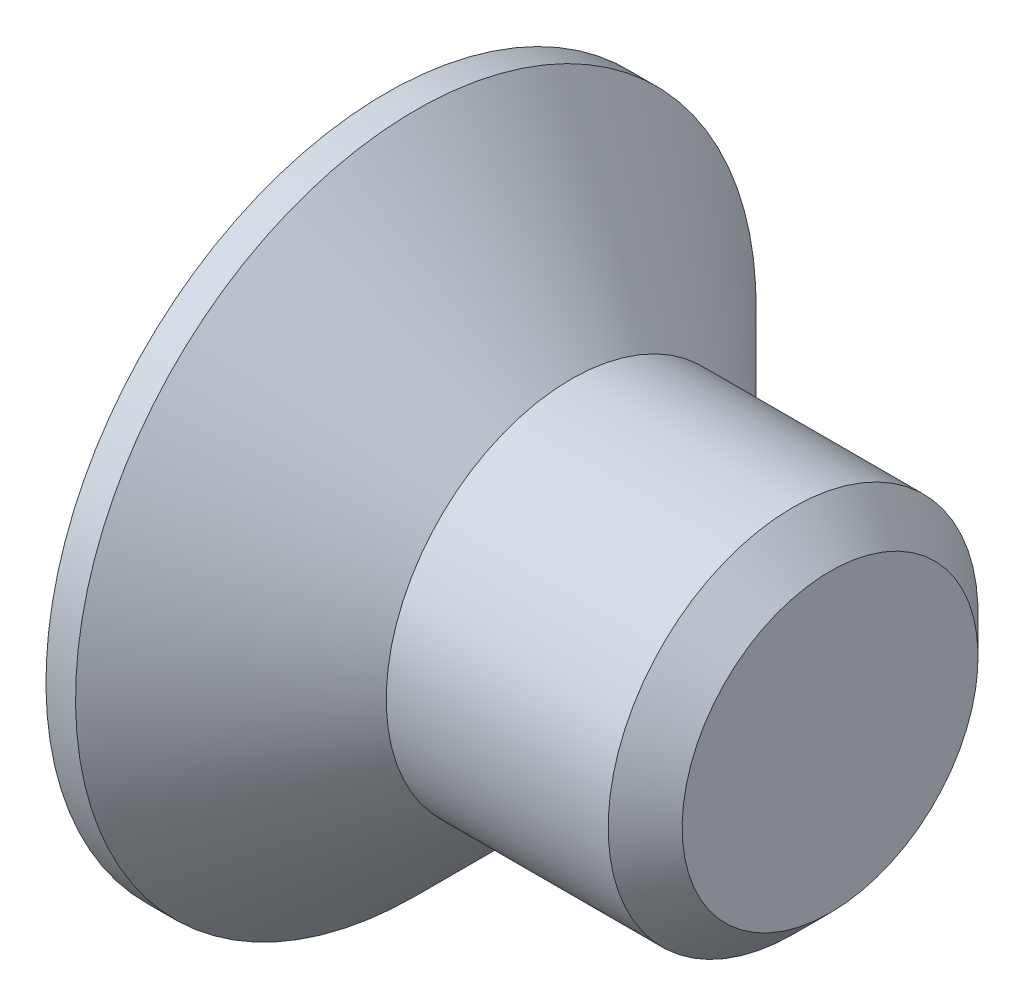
from build123d import *

# Parameters (mm, degrees)
CHAMFER1_SIZE      = 0.5
CUT_EXTRUDE1_DEPTH = 2.1


with BuildPart() as part:
    # Sketch1 → Revolve1 (revolve)
    with BuildSketch(Plane.XY, mode=Mode.PRIVATE) as revolve1_sk:
        Polygon((-2.5, 4.6), (-2.5, 0), (3.5, 0), (3.5, 2.5), (0, 2.5), (-2.1, 4.6), align=None)
    revolve(revolve1_sk.sketch.rotate(Axis((-2.5, 0, 0), (1, 0, 0)), 180), axis=Axis((-2.5, 0, 0), (1, 0, 0)))

    # Chamfer1
    chamfer1_edges = [part.edges().sort_by_distance(p)[0] for p in [
        (3.5, 2.5, 0),
    ]]
    chamfer(chamfer1_edges, length=CHAMFER1_SIZE)

    # Sketch2 → Cut-Extrude1 (cut)
    with BuildSketch(Plane.ZY.offset(2.5)):
        Polygon((-0.575, 2.3), (0.575, 2.3), (0.575, 0.575), (2.3, 0.575), (2.3, -0.575), (0.575, -0.575), (0.575, -2.3), (-0.575, -2.3), (-0.575, -0.575), (-2.3, -0.575), (-2.3, 0.575), (-0.575, 0.575), align=None)
    extrude(amount=-CUT_EXTRUDE1_DEPTH, mode=Mode.SUBTRACT)


solid = part.part
